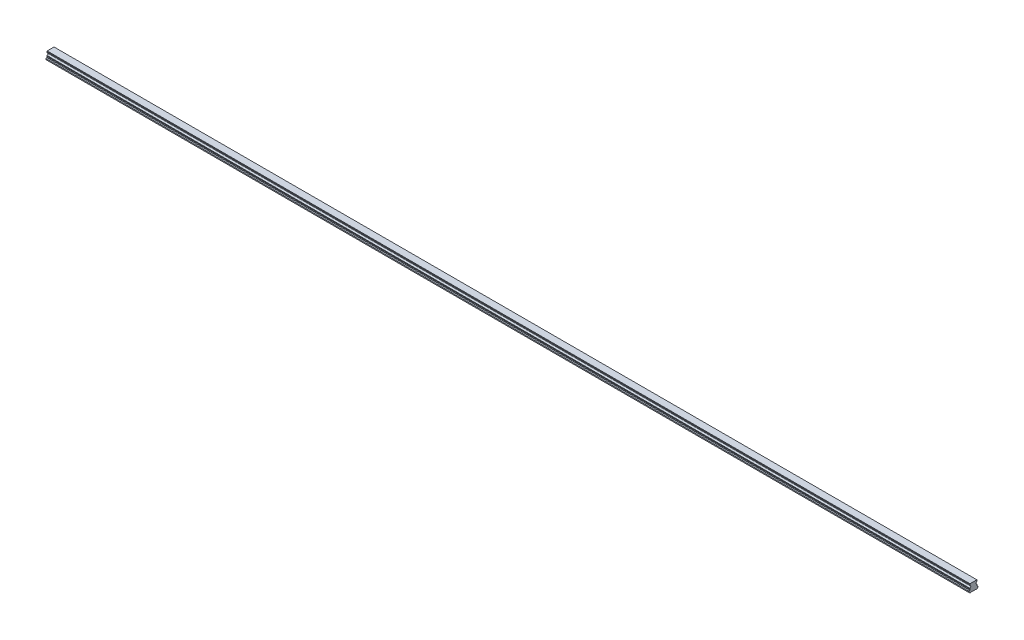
from build123d import *

# Parameters (mm, degrees)
BOSS_EXTRUDE1_DEPTH        = 2520
SKETCH3_R                  = 3
SKETCH3_R_2                = 2.5
CUT_EXTRUDE3_DEPTH         = 12
SKETCH3_2_R                = 2.5
CUT_EXTRUDE4_DEPTH         = 15
CHAMFER1_SIZE              = 0.5
LPATTERN4_COUNT            = 42
LPATTERN4_PITCH            = 60
CHAMFER1_OF_LPATTERN4_SIZE = 0.5


with BuildPart() as part:
    # Sketch1 → Boss-Extrude1 (new body)
    with BuildSketch(Plane(origin=(0, 0, 0), x_dir=(0, 0, -1), z_dir=(1, 0, 0))):
        with BuildLine():
            Line((9.375, 21.8), (-9.375, 21.8))
            Line((-9.375, 21.8), (-9.375, 20.756))
            Line((-9.375, 20.756), (-10, 19.415683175))
            Line((-10, 19.415683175), (-10, 17.685449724))
            ThreePointArc((-10, 17.685449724), (-7.2, 14.6), (-10, 11.514550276))
            Line((-10, 11.514550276), (-10, 9.784316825))
            Line((-10, 9.784316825), (-9.375, 8.444))
            Line((-9.375, 8.444), (-9.922688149, 6.4))
            Line((-9.922688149, 6.4), (-12.5, 5.489338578))
            Line((-12.5, 5.489338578), (-12.5, 2.65))
            Line((-12.5, 2.65), (-9.85, 0))
            Line((-9.85, 0), (-5.5, 0))
            Line((-5.5, 0), (-5, 0.5))
            Line((-5, 0.5), (5, 0.5))
            Line((5, 0.5), (5.5, 0))
            Line((5.5, 0), (9.85, 0))
            Line((9.85, 0), (12.5, 2.65))
            Line((12.5, 2.65), (12.5, 5.489338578))
            Line((12.5, 5.489338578), (9.922688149, 6.4))
            Line((9.922688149, 6.4), (9.375, 8.444))
            Line((9.375, 8.444), (10, 9.784316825))
            Line((10, 9.784316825), (10, 11.514550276))
            ThreePointArc((10, 11.514550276), (7.2, 14.6), (10, 17.685449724))
            Line((10, 17.685449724), (10, 19.415683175))
            Line((10, 19.415683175), (9.375, 20.756))
            Line((9.375, 20.756), (9.375, 21.8))
        make_face()
    extrude(amount=BOSS_EXTRUDE1_DEPTH)

    # Sketch3 → Cut-Extrude3 (cut)
    with BuildSketch(Plane.XZ):
        with Locations(Location((30, 0, 0), (0, 0, 270))):
            Circle(SKETCH3_R)
        with Locations(Location((30, 0, 0), (0, 0, 270))):
            Circle(SKETCH3_R_2, mode=Mode.SUBTRACT)
    cut_extrude3 = extrude(amount=-CUT_EXTRUDE3_DEPTH, mode=Mode.SUBTRACT)

    # Sketch3_2 → Cut-Extrude4 (cut)
    with BuildSketch(Plane.XZ):
        with Locations(Location((30, 0, 0), (0, 0, 270))):
            Circle(SKETCH3_2_R)
    cut_extrude4 = extrude(amount=-CUT_EXTRUDE4_DEPTH, mode=Mode.SUBTRACT)

    # Cut-Extrude5 cone 1 section (on through the dimple's axis) → Cut-Extrude5 (revolve, cut)
    with BuildSketch(Plane(origin=(30, 15, 0), x_dir=(0, 0, -1), z_dir=(1, 0, 0))):
        Polygon((0, 0), (2.5, 0), (0, 1.443375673), align=None)
    cut_extrude5 = revolve(axis=Axis((30, 15, 0), (0, 1, 0)), mode=Mode.SUBTRACT)

    # Chamfer1
    chamfer1_edges = [part.edges().sort_by_distance(p)[0] for p in [
        (30, 0.5, 3),
    ]]
    chamfer(chamfer1_edges, length=CHAMFER1_SIZE)

    # LPattern4: Cut-Extrude3, Cut-Extrude4, Cut-Extrude5 ×42
    with Locations(*[(i * LPATTERN4_PITCH, 0, 0) for i in range(1, LPATTERN4_COUNT)]):
        add(cut_extrude3, mode=Mode.SUBTRACT)
        add(cut_extrude4, mode=Mode.SUBTRACT)
        add(cut_extrude5, mode=Mode.SUBTRACT)

    # Chamfer1 of LPattern4
    chamfer1_of_lpattern4_edges = [part.edges().sort_by_distance(p)[0] for p in [
        (90, 0.5, 3),
        (150, 0.5, 3),
        (210, 0.5, 3),
        (270, 0.5, 3),
        (330, 0.5, 3),
        (390, 0.5, 3),
        (450, 0.5, 3),
        (510, 0.5, 3),
        (570, 0.5, 3),
        (630, 0.5, 3),
        (690, 0.5, 3),
        (750, 0.5, 3),
        (810, 0.5, 3),
        (870, 0.5, 3),
        (930, 0.5, 3),
        (990, 0.5, 3),
        (1050, 0.5, 3),
        (1110, 0.5, 3),
        (1170, 0.5, 3),
        (1230, 0.5, 3),
        (1290, 0.5, 3),
        (1350, 0.5, 3),
        (1410, 0.5, 3),
        (1470, 0.5, 3),
        (1530, 0.5, 3),
        (1590, 0.5, 3),
        (1650, 0.5, 3),
        (1710, 0.5, 3),
        (1770, 0.5, 3),
        (1830, 0.5, 3),
        (1890, 0.5, 3),
        (1950, 0.5, 3),
        (2010, 0.5, 3),
        (2070, 0.5, 3),
        (2130, 0.5, 3),
        (2190, 0.5, 3),
        (2250, 0.5, 3),
        (2310, 0.5, 3),
        (2370, 0.5, 3),
        (2430, 0.5, 3),
        (2490, 0.5, 3),
    ]]
    chamfer(chamfer1_of_lpattern4_edges, length=CHAMFER1_OF_LPATTERN4_SIZE)


solid = part.part
